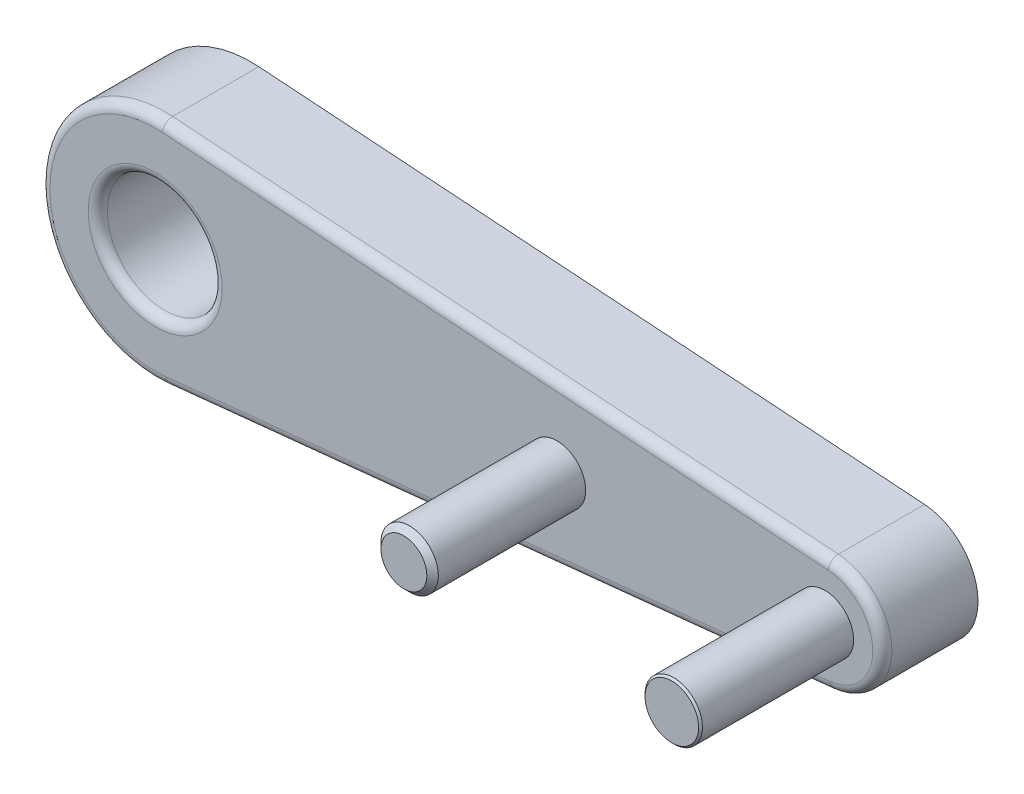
ISO-10303-21;
HEADER;
FILE_DESCRIPTION(('STEP AP214'),'2;1');
FILE_NAME('part.step','',(''),(''),'','','');
FILE_SCHEMA(('AUTOMOTIVE_DESIGN { 1 0 10303 214 1 1 1 1 }'));
ENDSEC;
DATA;
#1=APPLICATION_CONTEXT('core data for automotive mechanical design processes');
#2=APPLICATION_PROTOCOL_DEFINITION('international standard','automotive_design',2000,#1);
#3=PRODUCT_CONTEXT('',#1,'mechanical');
#4=PRODUCT('Part','Part','',(#3));
#5=PRODUCT_RELATED_PRODUCT_CATEGORY('part','',(#4));
#6=PRODUCT_DEFINITION_FORMATION('','',#4);
#7=PRODUCT_DEFINITION_CONTEXT('part definition',#1,'design');
#8=PRODUCT_DEFINITION('design','',#6,#7);
#9=PRODUCT_DEFINITION_SHAPE('','',#8);
#10=(LENGTH_UNIT() NAMED_UNIT(*) SI_UNIT(.MILLI.,.METRE.));
#11=(NAMED_UNIT(*) PLANE_ANGLE_UNIT() SI_UNIT($,.RADIAN.));
#12=(NAMED_UNIT(*) SI_UNIT($,.STERADIAN.) SOLID_ANGLE_UNIT());
#13=UNCERTAINTY_MEASURE_WITH_UNIT(LENGTH_MEASURE(1.E-05),#10,'distance_accuracy_value','');
#14=(GEOMETRIC_REPRESENTATION_CONTEXT(3) GLOBAL_UNCERTAINTY_ASSIGNED_CONTEXT((#13)) GLOBAL_UNIT_ASSIGNED_CONTEXT((#10,
#11,#12)) REPRESENTATION_CONTEXT('',''));
#15=CARTESIAN_POINT('',(0.,0.,0.));
#16=DIRECTION('',(0.,0.,1.));
#17=DIRECTION('',(1.,0.,0.));
#18=AXIS2_PLACEMENT_3D('',#15,#16,#17);
#19=CARTESIAN_POINT('',(0.,0.,50.));
#20=DIRECTION('',(0.,0.,1.));
#21=DIRECTION('',(1.,0.,0.));
#22=AXIS2_PLACEMENT_3D('',#19,#20,#21);
#23=PLANE('',#22);
#24=CARTESIAN_POINT('',(209.952209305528,3.46990491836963,50.));
#25=DIRECTION('',(0.,0.,1.));
#26=DIRECTION('',(1.,0.,0.));
#27=AXIS2_PLACEMENT_3D('',#24,#25,#26);
#28=CIRCLE('',#27,15.);
#29=CARTESIAN_POINT('',(224.952209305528,3.46990491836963,50.));
#30=VERTEX_POINT('',#29);
#31=EDGE_CURVE('E339',#30,#30,#28,.T.);
#32=ORIENTED_EDGE('',*,*,#31,.F.);
#33=EDGE_LOOP('',(#32));
#34=FACE_BOUND('',#33,.T.);
#35=CARTESIAN_POINT('',(0.,0.,50.));
#36=DIRECTION('',(0.,0.,1.));
#37=DIRECTION('',(1.,0.,0.));
#38=AXIS2_PLACEMENT_3D('',#35,#36,#37);
#39=CIRCLE('',#38,35.);
#40=CARTESIAN_POINT('',(35.,0.,50.));
#41=VERTEX_POINT('',#40);
#42=EDGE_CURVE('E138',#41,#41,#39,.F.);
#43=ORIENTED_EDGE('',*,*,#42,.T.);
#44=EDGE_LOOP('',(#43));
#45=FACE_BOUND('',#44,.T.);
#46=DIRECTION('',(-0.997600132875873,0.0692385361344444,0.));
#47=VECTOR('',#46,1.);
#48=CARTESIAN_POINT('',(3.80811948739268,54.8680073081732,50.));
#49=LINE('',#48,#47);
#50=CARTESIAN_POINT('',(351.683172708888,30.7237047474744,50.));
#51=VERTEX_POINT('',#50);
#52=CARTESIAN_POINT('',(3.80811948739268,54.8680073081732,50.));
#53=VERTEX_POINT('',#52);
#54=EDGE_CURVE('E129',#51,#53,#49,.T.);
#55=ORIENTED_EDGE('',*,*,#54,.T.);
#56=CARTESIAN_POINT('',(0.,0.,50.));
#57=DIRECTION('',(0.,0.,1.));
#58=DIRECTION('',(1.,0.,0.));
#59=AXIS2_PLACEMENT_3D('',#56,#57,#58);
#60=CIRCLE('',#59,55.);
#61=CARTESIAN_POINT('',(5.61916451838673,-54.7122014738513,50.));
#62=VERTEX_POINT('',#61);
#63=EDGE_CURVE('E135',#53,#62,#60,.T.);
#64=ORIENTED_EDGE('',*,*,#63,.T.);
#65=DIRECTION('',(0.99476729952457,0.102166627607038,0.));
#66=VECTOR('',#65,1.);
#67=CARTESIAN_POINT('',(352.506374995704,-19.0854810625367,50.));
#68=LINE('',#67,#66);
#69=CARTESIAN_POINT('',(352.506374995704,-19.0854810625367,50.));
#70=VERTEX_POINT('',#69);
#71=EDGE_CURVE('E133',#62,#70,#68,.T.);
#72=ORIENTED_EDGE('',*,*,#71,.T.);
#73=CARTESIAN_POINT('',(349.952209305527,5.7837014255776,50.));
#74=DIRECTION('',(0.,0.,1.));
#75=DIRECTION('',(1.,0.,0.));
#76=AXIS2_PLACEMENT_3D('',#73,#74,#75);
#77=CIRCLE('',#76,25.);
#78=EDGE_CURVE('E131',#70,#51,#77,.T.);
#79=ORIENTED_EDGE('',*,*,#78,.T.);
#80=EDGE_LOOP('',(#55,#64,#72,#79));
#81=FACE_BOUND('',#80,.T.);
#82=CARTESIAN_POINT('',(349.952209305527,5.7837014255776,50.));
#83=DIRECTION('',(0.,0.,1.));
#84=DIRECTION('',(1.,0.,0.));
#85=AXIS2_PLACEMENT_3D('',#82,#83,#84);
#86=CIRCLE('',#85,15.);
#87=CARTESIAN_POINT('',(364.952209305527,5.7837014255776,50.));
#88=VERTEX_POINT('',#87);
#89=EDGE_CURVE('E337',#88,#88,#86,.T.);
#90=ORIENTED_EDGE('',*,*,#89,.F.);
#91=EDGE_LOOP('',(#90));
#92=FACE_BOUND('',#91,.T.);
#93=ADVANCED_FACE('F34',(#34,#45,#81,#92),#23,.T.);
#94=CARTESIAN_POINT('',(0.,0.,0.));
#95=DIRECTION('',(0.,0.,1.));
#96=DIRECTION('',(1.,0.,0.));
#97=AXIS2_PLACEMENT_3D('',#94,#95,#96);
#98=PLANE('',#97);
#99=CARTESIAN_POINT('',(0.,0.,0.));
#100=DIRECTION('',(0.,0.,1.));
#101=DIRECTION('',(1.,0.,0.));
#102=AXIS2_PLACEMENT_3D('',#99,#100,#101);
#103=CIRCLE('',#102,60.);
#104=CARTESIAN_POINT('',(4.15431216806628,59.8560079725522,0.));
#105=VERTEX_POINT('',#104);
#106=CARTESIAN_POINT('',(6.12999765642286,-59.6860379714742,0.));
#107=VERTEX_POINT('',#106);
#108=EDGE_CURVE('E107',#105,#107,#103,.T.);
#109=ORIENTED_EDGE('',*,*,#108,.F.);
#110=DIRECTION('',(-0.997600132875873,0.0692385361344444,0.));
#111=VECTOR('',#110,1.);
#112=CARTESIAN_POINT('',(4.15431216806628,59.8560079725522,0.));
#113=LINE('',#112,#111);
#114=CARTESIAN_POINT('',(352.02936538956,35.7117054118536,0.));
#115=VERTEX_POINT('',#114);
#116=EDGE_CURVE('E121',#115,#105,#113,.T.);
#117=ORIENTED_EDGE('',*,*,#116,.F.);
#118=CARTESIAN_POINT('',(349.952209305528,5.78370142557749,0.));
#119=DIRECTION('',(0.,0.,1.));
#120=DIRECTION('',(1.,0.,0.));
#121=AXIS2_PLACEMENT_3D('',#118,#119,#120);
#122=CIRCLE('',#121,30.);
#123=CARTESIAN_POINT('',(353.017208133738,-24.0593175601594,0.));
#124=VERTEX_POINT('',#123);
#125=EDGE_CURVE('E109',#124,#115,#122,.T.);
#126=ORIENTED_EDGE('',*,*,#125,.F.);
#127=DIRECTION('',(0.99476729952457,0.102166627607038,0.));
#128=VECTOR('',#127,1.);
#129=CARTESIAN_POINT('',(6.12999765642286,-59.6860379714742,0.));
#130=LINE('',#129,#128);
#131=EDGE_CURVE('E91',#107,#124,#130,.T.);
#132=ORIENTED_EDGE('',*,*,#131,.F.);
#133=EDGE_LOOP('',(#109,#117,#126,#132));
#134=FACE_BOUND('',#133,.T.);
#135=CARTESIAN_POINT('',(0.,0.,0.));
#136=DIRECTION('',(0.,0.,1.));
#137=DIRECTION('',(1.,0.,0.));
#138=AXIS2_PLACEMENT_3D('',#135,#136,#137);
#139=CIRCLE('',#138,30.);
#140=CARTESIAN_POINT('',(30.,0.,0.));
#141=VERTEX_POINT('',#140);
#142=EDGE_CURVE('E113',#141,#141,#139,.T.);
#143=ORIENTED_EDGE('',*,*,#142,.T.);
#144=EDGE_LOOP('',(#143));
#145=FACE_BOUND('',#144,.T.);
#146=ADVANCED_FACE('F104',(#134,#145),#98,.F.);
#147=CARTESIAN_POINT('',(0.,0.,50.));
#148=DIRECTION('',(0.,0.,-1.));
#149=DIRECTION('',(-1.,0.,0.));
#150=AXIS2_PLACEMENT_3D('',#147,#148,#149);
#151=CYLINDRICAL_SURFACE('',#150,60.);
#152=DIRECTION('',(0.,0.,-1.));
#153=VECTOR('',#152,1.);
#154=CARTESIAN_POINT('',(6.12999765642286,-59.6860379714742,50.));
#155=LINE('',#154,#153);
#156=CARTESIAN_POINT('',(6.12999765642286,-59.6860379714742,45.));
#157=VERTEX_POINT('',#156);
#158=EDGE_CURVE('E88',#157,#107,#155,.T.);
#159=ORIENTED_EDGE('',*,*,#158,.F.);
#160=CARTESIAN_POINT('',(0.,0.,45.));
#161=DIRECTION('',(0.,0.,1.));
#162=DIRECTION('',(1.,0.,0.));
#163=AXIS2_PLACEMENT_3D('',#160,#161,#162);
#164=CIRCLE('',#163,60.);
#165=CARTESIAN_POINT('',(4.15431216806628,59.8560079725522,45.));
#166=VERTEX_POINT('',#165);
#167=EDGE_CURVE('E141',#157,#166,#164,.F.);
#168=ORIENTED_EDGE('',*,*,#167,.T.);
#169=DIRECTION('',(0.,0.,-1.));
#170=VECTOR('',#169,1.);
#171=CARTESIAN_POINT('',(4.15431216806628,59.8560079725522,50.));
#172=LINE('',#171,#170);
#173=EDGE_CURVE('E111',#166,#105,#172,.T.);
#174=ORIENTED_EDGE('',*,*,#173,.T.);
#175=ORIENTED_EDGE('',*,*,#108,.T.);
#176=EDGE_LOOP('',(#159,#168,#174,#175));
#177=FACE_BOUND('',#176,.T.);
#178=ADVANCED_FACE('F36',(#177),#151,.T.);
#179=CARTESIAN_POINT('',(6.12999765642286,-59.6860379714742,50.));
#180=DIRECTION('',(-0.102166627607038,0.99476729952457,0.));
#181=DIRECTION('',(-0.99476729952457,-0.102166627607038,0.));
#182=AXIS2_PLACEMENT_3D('',#179,#180,#181);
#183=PLANE('',#182);
#184=DIRECTION('',(0.,0.,-1.));
#185=VECTOR('',#184,1.);
#186=CARTESIAN_POINT('',(353.017208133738,-24.0593175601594,50.));
#187=LINE('',#186,#185);
#188=CARTESIAN_POINT('',(353.017208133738,-24.0593175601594,45.));
#189=VERTEX_POINT('',#188);
#190=EDGE_CURVE('E100',#189,#124,#187,.T.);
#191=ORIENTED_EDGE('',*,*,#190,.F.);
#192=DIRECTION('',(0.99476729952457,0.102166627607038,0.));
#193=VECTOR('',#192,1.);
#194=CARTESIAN_POINT('',(6.12999765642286,-59.6860379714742,45.));
#195=LINE('',#194,#193);
#196=EDGE_CURVE('E94',#189,#157,#195,.F.);
#197=ORIENTED_EDGE('',*,*,#196,.T.);
#198=ORIENTED_EDGE('',*,*,#158,.T.);
#199=ORIENTED_EDGE('',*,*,#131,.T.);
#200=EDGE_LOOP('',(#191,#197,#198,#199));
#201=FACE_BOUND('',#200,.T.);
#202=ADVANCED_FACE('F90',(#201),#183,.F.);
#203=CARTESIAN_POINT('',(349.952209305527,5.7837014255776,50.));
#204=DIRECTION('',(0.,0.,-1.));
#205=DIRECTION('',(-1.,0.,0.));
#206=AXIS2_PLACEMENT_3D('',#203,#204,#205);
#207=CYLINDRICAL_SURFACE('',#206,30.);
#208=DIRECTION('',(0.,0.,-1.));
#209=VECTOR('',#208,1.);
#210=CARTESIAN_POINT('',(352.02936538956,35.7117054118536,50.));
#211=LINE('',#210,#209);
#212=CARTESIAN_POINT('',(352.02936538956,35.7117054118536,45.));
#213=VERTEX_POINT('',#212);
#214=EDGE_CURVE('E124',#213,#115,#211,.T.);
#215=ORIENTED_EDGE('',*,*,#214,.F.);
#216=CARTESIAN_POINT('',(349.952209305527,5.7837014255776,45.));
#217=DIRECTION('',(0.,0.,1.));
#218=DIRECTION('',(1.,0.,0.));
#219=AXIS2_PLACEMENT_3D('',#216,#217,#218);
#220=CIRCLE('',#219,30.);
#221=EDGE_CURVE('E56',#213,#189,#220,.F.);
#222=ORIENTED_EDGE('',*,*,#221,.T.);
#223=ORIENTED_EDGE('',*,*,#190,.T.);
#224=ORIENTED_EDGE('',*,*,#125,.T.);
#225=EDGE_LOOP('',(#215,#222,#223,#224));
#226=FACE_BOUND('',#225,.T.);
#227=ADVANCED_FACE('F181',(#226),#207,.T.);
#228=CARTESIAN_POINT('',(4.15431216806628,59.8560079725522,50.));
#229=DIRECTION('',(-0.0692385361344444,-0.997600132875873,0.));
#230=DIRECTION('',(0.997600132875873,-0.0692385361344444,0.));
#231=AXIS2_PLACEMENT_3D('',#228,#229,#230);
#232=PLANE('',#231);
#233=ORIENTED_EDGE('',*,*,#173,.F.);
#234=DIRECTION('',(-0.997600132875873,0.0692385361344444,0.));
#235=VECTOR('',#234,1.);
#236=CARTESIAN_POINT('',(352.02936538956,35.7117054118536,45.));
#237=LINE('',#236,#235);
#238=EDGE_CURVE('E49',#166,#213,#237,.F.);
#239=ORIENTED_EDGE('',*,*,#238,.T.);
#240=ORIENTED_EDGE('',*,*,#214,.T.);
#241=ORIENTED_EDGE('',*,*,#116,.T.);
#242=EDGE_LOOP('',(#233,#239,#240,#241));
#243=FACE_BOUND('',#242,.T.);
#244=ADVANCED_FACE('F177',(#243),#232,.F.);
#245=CARTESIAN_POINT('',(0.,0.,50.));
#246=DIRECTION('',(0.,0.,-1.));
#247=DIRECTION('',(-1.,0.,0.));
#248=AXIS2_PLACEMENT_3D('',#245,#246,#247);
#249=CYLINDRICAL_SURFACE('',#248,30.);
#250=CARTESIAN_POINT('',(0.,0.,45.));
#251=DIRECTION('',(0.,0.,1.));
#252=DIRECTION('',(1.,0.,0.));
#253=AXIS2_PLACEMENT_3D('',#250,#251,#252);
#254=CIRCLE('',#253,30.);
#255=CARTESIAN_POINT('',(30.,0.,45.));
#256=VERTEX_POINT('',#255);
#257=EDGE_CURVE('E99',#256,#256,#254,.T.);
#258=ORIENTED_EDGE('',*,*,#257,.T.);
#259=EDGE_LOOP('',(#258));
#260=FACE_BOUND('',#259,.T.);
#261=ORIENTED_EDGE('',*,*,#142,.F.);
#262=EDGE_LOOP('',(#261));
#263=FACE_BOUND('',#262,.T.);
#264=ADVANCED_FACE('F180',(#260,#263),#249,.F.);
#265=CARTESIAN_POINT('',(0.,0.,45.));
#266=DIRECTION('',(0.,0.,1.));
#267=DIRECTION('',(1.,0.,0.));
#268=AXIS2_PLACEMENT_3D('',#265,#266,#267);
#269=TOROIDAL_SURFACE('',#268,35.,5.);
#270=ORIENTED_EDGE('',*,*,#42,.F.);
#271=EDGE_LOOP('',(#270));
#272=FACE_BOUND('',#271,.T.);
#273=ORIENTED_EDGE('',*,*,#257,.F.);
#274=EDGE_LOOP('',(#273));
#275=FACE_BOUND('',#274,.T.);
#276=ADVANCED_FACE('F275',(#272,#275),#269,.T.);
#277=CARTESIAN_POINT('',(349.952209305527,5.7837014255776,45.));
#278=DIRECTION('',(0.,0.,1.));
#279=DIRECTION('',(1.,0.,0.));
#280=AXIS2_PLACEMENT_3D('',#277,#278,#279);
#281=TOROIDAL_SURFACE('',#280,25.,5.);
#282=CARTESIAN_POINT('',(352.506374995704,-19.0854810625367,45.));
#283=DIRECTION('',(-0.99476729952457,-0.102166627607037,0.));
#284=DIRECTION('',(0.102166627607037,-0.99476729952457,0.));
#285=AXIS2_PLACEMENT_3D('',#282,#283,#284);
#286=CIRCLE('',#285,5.);
#287=EDGE_CURVE('E348',#189,#70,#286,.T.);
#288=ORIENTED_EDGE('',*,*,#287,.F.);
#289=ORIENTED_EDGE('',*,*,#221,.F.);
#290=CARTESIAN_POINT('',(351.683172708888,30.7237047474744,45.));
#291=DIRECTION('',(-0.997600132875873,0.0692385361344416,0.));
#292=DIRECTION('',(-0.0692385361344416,-0.997600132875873,0.));
#293=AXIS2_PLACEMENT_3D('',#290,#291,#292);
#294=CIRCLE('',#293,5.);
#295=EDGE_CURVE('E116',#51,#213,#294,.T.);
#296=ORIENTED_EDGE('',*,*,#295,.F.);
#297=ORIENTED_EDGE('',*,*,#78,.F.);
#298=EDGE_LOOP('',(#288,#289,#296,#297));
#299=FACE_BOUND('',#298,.T.);
#300=ADVANCED_FACE('F267',(#299),#281,.T.);
#301=CARTESIAN_POINT('',(3.80811948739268,54.8680073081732,45.));
#302=DIRECTION('',(0.997600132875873,-0.0692385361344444,0.));
#303=DIRECTION('',(0.0692385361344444,0.997600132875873,0.));
#304=AXIS2_PLACEMENT_3D('',#301,#302,#303);
#305=CYLINDRICAL_SURFACE('',#304,5.);
#306=ORIENTED_EDGE('',*,*,#295,.T.);
#307=ORIENTED_EDGE('',*,*,#238,.F.);
#308=CARTESIAN_POINT('',(3.80811948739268,54.8680073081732,45.));
#309=DIRECTION('',(-0.997600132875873,0.0692385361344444,0.));
#310=DIRECTION('',(-0.0692385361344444,-0.997600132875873,0.));
#311=AXIS2_PLACEMENT_3D('',#308,#309,#310);
#312=CIRCLE('',#311,5.);
#313=EDGE_CURVE('E346',#53,#166,#312,.T.);
#314=ORIENTED_EDGE('',*,*,#313,.F.);
#315=ORIENTED_EDGE('',*,*,#54,.F.);
#316=EDGE_LOOP('',(#306,#307,#314,#315));
#317=FACE_BOUND('',#316,.T.);
#318=ADVANCED_FACE('F259',(#317),#305,.T.);
#319=CARTESIAN_POINT('',(5.61916451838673,-54.7122014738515,45.));
#320=DIRECTION('',(-0.99476729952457,-0.102166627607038,0.));
#321=DIRECTION('',(0.102166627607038,-0.99476729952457,0.));
#322=AXIS2_PLACEMENT_3D('',#319,#320,#321);
#323=CYLINDRICAL_SURFACE('',#322,5.);
#324=ORIENTED_EDGE('',*,*,#287,.T.);
#325=ORIENTED_EDGE('',*,*,#71,.F.);
#326=CARTESIAN_POINT('',(5.61916451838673,-54.7122014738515,45.));
#327=DIRECTION('',(-0.99476729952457,-0.102166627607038,0.));
#328=DIRECTION('',(0.102166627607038,-0.99476729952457,0.));
#329=AXIS2_PLACEMENT_3D('',#326,#327,#328);
#330=CIRCLE('',#329,5.);
#331=EDGE_CURVE('E342',#157,#62,#330,.T.);
#332=ORIENTED_EDGE('',*,*,#331,.F.);
#333=ORIENTED_EDGE('',*,*,#196,.F.);
#334=EDGE_LOOP('',(#324,#325,#332,#333));
#335=FACE_BOUND('',#334,.T.);
#336=ADVANCED_FACE('F251',(#335),#323,.T.);
#337=CARTESIAN_POINT('',(0.,0.,45.));
#338=DIRECTION('',(0.,0.,1.));
#339=DIRECTION('',(1.,0.,0.));
#340=AXIS2_PLACEMENT_3D('',#337,#338,#339);
#341=TOROIDAL_SURFACE('',#340,55.,5.);
#342=ORIENTED_EDGE('',*,*,#313,.T.);
#343=ORIENTED_EDGE('',*,*,#167,.F.);
#344=ORIENTED_EDGE('',*,*,#331,.T.);
#345=ORIENTED_EDGE('',*,*,#63,.F.);
#346=EDGE_LOOP('',(#342,#343,#344,#345));
#347=FACE_BOUND('',#346,.T.);
#348=ADVANCED_FACE('F243',(#347),#341,.T.);
#349=CARTESIAN_POINT('',(209.952209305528,3.46990491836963,130.));
#350=DIRECTION('',(0.,0.,-1.));
#351=DIRECTION('',(-1.,0.,0.));
#352=AXIS2_PLACEMENT_3D('',#349,#350,#351);
#353=CYLINDRICAL_SURFACE('',#352,15.);
#354=CARTESIAN_POINT('',(209.952209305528,3.46990491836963,127.));
#355=DIRECTION('',(0.,0.,1.));
#356=DIRECTION('',(1.,0.,0.));
#357=AXIS2_PLACEMENT_3D('',#354,#355,#356);
#358=CIRCLE('',#357,15.);
#359=CARTESIAN_POINT('',(224.952209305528,3.46990491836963,127.));
#360=VERTEX_POINT('',#359);
#361=EDGE_CURVE('E149',#360,#360,#358,.F.);
#362=ORIENTED_EDGE('',*,*,#361,.T.);
#363=EDGE_LOOP('',(#362));
#364=FACE_BOUND('',#363,.T.);
#365=ORIENTED_EDGE('',*,*,#31,.T.);
#366=EDGE_LOOP('',(#365));
#367=FACE_BOUND('',#366,.T.);
#368=ADVANCED_FACE('F236',(#364,#367),#353,.T.);
#369=CARTESIAN_POINT('',(209.952209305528,3.46990491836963,130.));
#370=DIRECTION('',(0.,0.,1.));
#371=DIRECTION('',(1.,0.,0.));
#372=AXIS2_PLACEMENT_3D('',#369,#370,#371);
#373=PLANE('',#372);
#374=CARTESIAN_POINT('',(209.952209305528,3.46990491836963,130.));
#375=DIRECTION('',(0.,0.,1.));
#376=DIRECTION('',(1.,0.,0.));
#377=AXIS2_PLACEMENT_3D('',#374,#375,#376);
#378=CIRCLE('',#377,12.);
#379=CARTESIAN_POINT('',(221.952209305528,3.46990491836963,130.));
#380=VERTEX_POINT('',#379);
#381=EDGE_CURVE('E146',#380,#380,#378,.T.);
#382=ORIENTED_EDGE('',*,*,#381,.T.);
#383=EDGE_LOOP('',(#382));
#384=FACE_BOUND('',#383,.T.);
#385=ADVANCED_FACE('F229',(#384),#373,.T.);
#386=CARTESIAN_POINT('',(209.952209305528,3.46990491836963,130.));
#387=DIRECTION('',(0.,0.,-1.));
#388=DIRECTION('',(-1.,0.,0.));
#389=AXIS2_PLACEMENT_3D('',#386,#387,#388);
#390=CONICAL_SURFACE('',#389,12.,0.78539816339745);
#391=ORIENTED_EDGE('',*,*,#361,.F.);
#392=EDGE_LOOP('',(#391));
#393=FACE_BOUND('',#392,.T.);
#394=ORIENTED_EDGE('',*,*,#381,.F.);
#395=EDGE_LOOP('',(#394));
#396=FACE_BOUND('',#395,.T.);
#397=ADVANCED_FACE('F203',(#393,#396),#390,.T.);
#398=CARTESIAN_POINT('',(349.952209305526,5.7837014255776,130.));
#399=DIRECTION('',(0.,0.,-1.));
#400=DIRECTION('',(-1.,0.,0.));
#401=AXIS2_PLACEMENT_3D('',#398,#399,#400);
#402=CYLINDRICAL_SURFACE('',#401,15.);
#403=CARTESIAN_POINT('',(349.952209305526,5.7837014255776,129.));
#404=DIRECTION('',(0.,0.,1.));
#405=DIRECTION('',(1.,0.,0.));
#406=AXIS2_PLACEMENT_3D('',#403,#404,#405);
#407=CIRCLE('',#406,15.);
#408=CARTESIAN_POINT('',(364.952209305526,5.7837014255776,129.));
#409=VERTEX_POINT('',#408);
#410=EDGE_CURVE('E11',#409,#409,#407,.F.);
#411=ORIENTED_EDGE('',*,*,#410,.T.);
#412=EDGE_LOOP('',(#411));
#413=FACE_BOUND('',#412,.T.);
#414=ORIENTED_EDGE('',*,*,#89,.T.);
#415=EDGE_LOOP('',(#414));
#416=FACE_BOUND('',#415,.T.);
#417=ADVANCED_FACE('F163',(#413,#416),#402,.T.);
#418=CARTESIAN_POINT('',(349.952209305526,5.7837014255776,130.));
#419=DIRECTION('',(0.,0.,1.));
#420=DIRECTION('',(1.,0.,0.));
#421=AXIS2_PLACEMENT_3D('',#418,#419,#420);
#422=PLANE('',#421);
#423=CARTESIAN_POINT('',(349.952209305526,5.7837014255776,130.));
#424=DIRECTION('',(0.,0.,1.));
#425=DIRECTION('',(1.,0.,0.));
#426=AXIS2_PLACEMENT_3D('',#423,#424,#425);
#427=CIRCLE('',#426,14.);
#428=CARTESIAN_POINT('',(363.952209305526,5.7837014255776,130.));
#429=VERTEX_POINT('',#428);
#430=EDGE_CURVE('E42',#429,#429,#427,.T.);
#431=ORIENTED_EDGE('',*,*,#430,.T.);
#432=EDGE_LOOP('',(#431));
#433=FACE_BOUND('',#432,.T.);
#434=ADVANCED_FACE('F154',(#433),#422,.T.);
#435=CARTESIAN_POINT('',(349.952209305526,5.7837014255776,130.));
#436=DIRECTION('',(0.,0.,-1.));
#437=DIRECTION('',(-1.,0.,0.));
#438=AXIS2_PLACEMENT_3D('',#435,#436,#437);
#439=CONICAL_SURFACE('',#438,14.,0.785398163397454);
#440=ORIENTED_EDGE('',*,*,#410,.F.);
#441=EDGE_LOOP('',(#440));
#442=FACE_BOUND('',#441,.T.);
#443=ORIENTED_EDGE('',*,*,#430,.F.);
#444=EDGE_LOOP('',(#443));
#445=FACE_BOUND('',#444,.T.);
#446=ADVANCED_FACE('F156',(#442,#445),#439,.T.);
#447=CLOSED_SHELL('',(#93,#146,#178,#202,#227,#244,#264,#276,#300,#318,#336,#348,#368,#385,#397,
#417,#434,#446));
#448=MANIFOLD_SOLID_BREP('B2',#447);
#449=ADVANCED_BREP_SHAPE_REPRESENTATION('',(#18,#448),#14);
#450=SHAPE_DEFINITION_REPRESENTATION(#9,#449);
ENDSEC;
END-ISO-10303-21;
